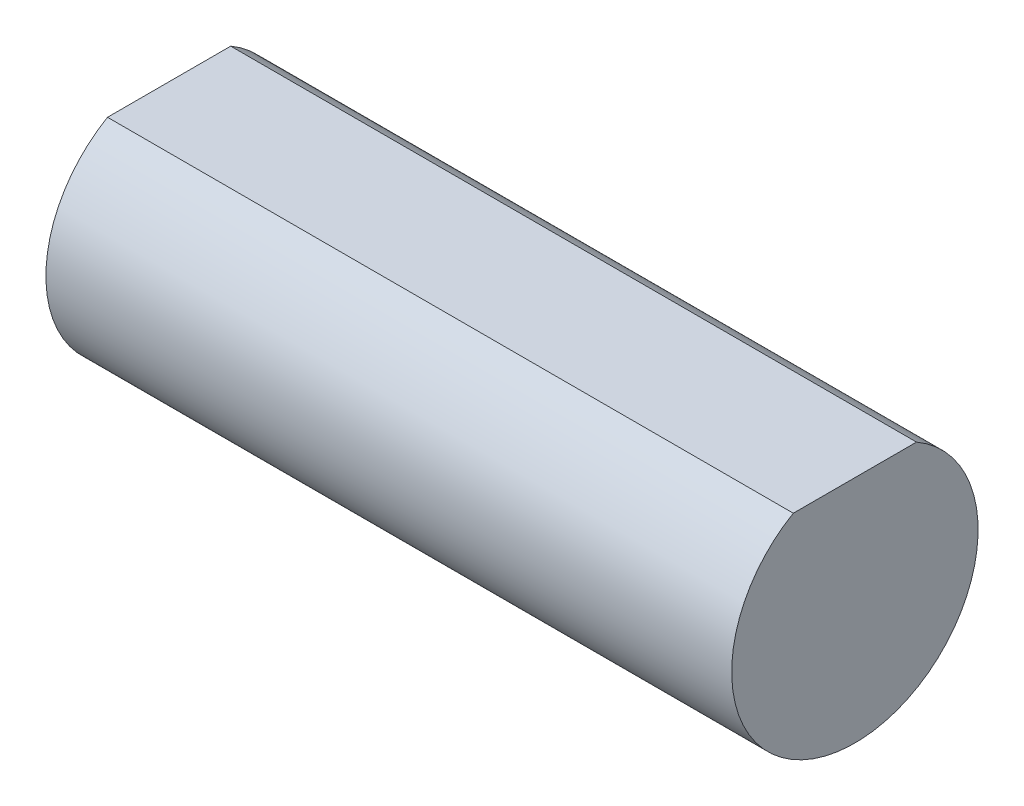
from build123d import *

# Parameters (mm, degrees)
BOSS_EXTRUDE1_DEPTH = 16.7


with BuildPart() as part:
    # Sketch1 → Boss-Extrude1 (new body)
    with BuildSketch(Plane(origin=(0, 0, 0), x_dir=(0, 0, -1), z_dir=(1, 0, 0))):
        with BuildLine():
            Line((1.5, 2.598076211), (-1.5, 2.598076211))
            ThreePointArc((-1.5, 2.598076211), (0, -3), (1.5, 2.598076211))
        make_face()
    extrude(amount=BOSS_EXTRUDE1_DEPTH)


solid = part.part
